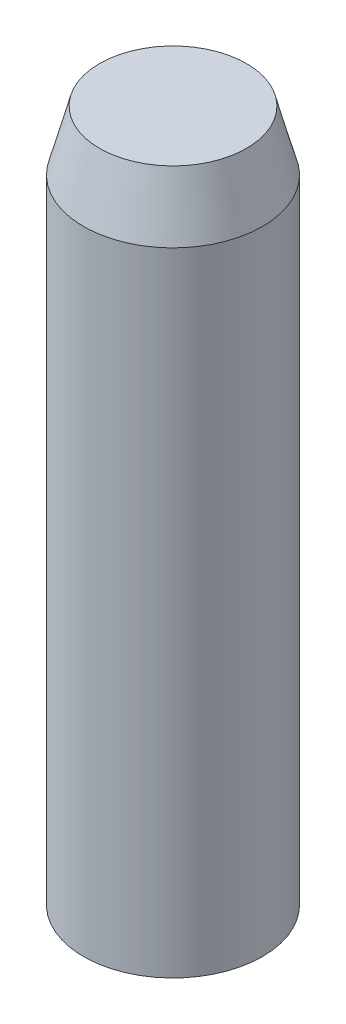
ISO-10303-21;
HEADER;
FILE_DESCRIPTION(('STEP AP214'),'2;1');
FILE_NAME('part.step','',(''),(''),'','','');
FILE_SCHEMA(('AUTOMOTIVE_DESIGN { 1 0 10303 214 1 1 1 1 }'));
ENDSEC;
DATA;
#1=APPLICATION_CONTEXT('core data for automotive mechanical design processes');
#2=APPLICATION_PROTOCOL_DEFINITION('international standard','automotive_design',2000,#1);
#3=PRODUCT_CONTEXT('',#1,'mechanical');
#4=PRODUCT('Part','Part','',(#3));
#5=PRODUCT_RELATED_PRODUCT_CATEGORY('part','',(#4));
#6=PRODUCT_DEFINITION_FORMATION('','',#4);
#7=PRODUCT_DEFINITION_CONTEXT('part definition',#1,'design');
#8=PRODUCT_DEFINITION('design','',#6,#7);
#9=PRODUCT_DEFINITION_SHAPE('','',#8);
#10=(LENGTH_UNIT() NAMED_UNIT(*) SI_UNIT(.MILLI.,.METRE.));
#11=(NAMED_UNIT(*) PLANE_ANGLE_UNIT() SI_UNIT($,.RADIAN.));
#12=(NAMED_UNIT(*) SI_UNIT($,.STERADIAN.) SOLID_ANGLE_UNIT());
#13=UNCERTAINTY_MEASURE_WITH_UNIT(LENGTH_MEASURE(1.E-05),#10,'distance_accuracy_value','');
#14=(GEOMETRIC_REPRESENTATION_CONTEXT(3) GLOBAL_UNCERTAINTY_ASSIGNED_CONTEXT((#13)) GLOBAL_UNIT_ASSIGNED_CONTEXT((#10,
#11,#12)) REPRESENTATION_CONTEXT('',''));
#15=CARTESIAN_POINT('',(0.,0.,0.));
#16=DIRECTION('',(0.,0.,1.));
#17=DIRECTION('',(1.,0.,0.));
#18=AXIS2_PLACEMENT_3D('',#15,#16,#17);
#19=CARTESIAN_POINT('',(0.,16.,0.));
#20=DIRECTION('',(0.,-1.,0.));
#21=DIRECTION('',(1.,0.,0.));
#22=AXIS2_PLACEMENT_3D('',#19,#20,#21);
#23=PLANE('',#22);
#24=CARTESIAN_POINT('',(0.,16.,0.));
#25=DIRECTION('',(0.,1.,0.));
#26=DIRECTION('',(-1.,0.,0.));
#27=AXIS2_PLACEMENT_3D('',#24,#25,#26);
#28=CIRCLE('',#27,1.64273441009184);
#29=CARTESIAN_POINT('',(-1.64273441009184,16.,0.));
#30=VERTEX_POINT('',#29);
#31=EDGE_CURVE('E10',#30,#30,#28,.T.);
#32=ORIENTED_EDGE('',*,*,#31,.T.);
#33=EDGE_LOOP('',(#32));
#34=FACE_BOUND('',#33,.T.);
#35=ADVANCED_FACE('F34',(#34),#23,.F.);
#36=CARTESIAN_POINT('',(0.,14.6666666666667,0.));
#37=DIRECTION('',(0.,-1.,0.));
#38=DIRECTION('',(1.,0.,0.));
#39=AXIS2_PLACEMENT_3D('',#36,#37,#38);
#40=CONICAL_SURFACE('',#39,2.,0.261799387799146);
#41=ORIENTED_EDGE('',*,*,#31,.F.);
#42=EDGE_LOOP('',(#41));
#43=FACE_BOUND('',#42,.T.);
#44=CARTESIAN_POINT('',(0.,14.6666666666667,0.));
#45=DIRECTION('',(0.,1.,0.));
#46=DIRECTION('',(-1.,0.,0.));
#47=AXIS2_PLACEMENT_3D('',#44,#45,#46);
#48=CIRCLE('',#47,2.);
#49=CARTESIAN_POINT('',(-2.,14.6666666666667,0.));
#50=VERTEX_POINT('',#49);
#51=EDGE_CURVE('E40',#50,#50,#48,.T.);
#52=ORIENTED_EDGE('',*,*,#51,.T.);
#53=EDGE_LOOP('',(#52));
#54=FACE_BOUND('',#53,.T.);
#55=ADVANCED_FACE('F59',(#43,#54),#40,.T.);
#56=CARTESIAN_POINT('',(0.,16.,0.));
#57=DIRECTION('',(0.,1.,0.));
#58=DIRECTION('',(-1.,0.,0.));
#59=AXIS2_PLACEMENT_3D('',#56,#57,#58);
#60=CYLINDRICAL_SURFACE('',#59,2.);
#61=ORIENTED_EDGE('',*,*,#51,.F.);
#62=EDGE_LOOP('',(#61));
#63=FACE_BOUND('',#62,.T.);
#64=CARTESIAN_POINT('',(0.,0.535898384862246,0.));
#65=DIRECTION('',(0.,1.,0.));
#66=DIRECTION('',(-1.,0.,0.));
#67=AXIS2_PLACEMENT_3D('',#64,#65,#66);
#68=CIRCLE('',#67,2.);
#69=CARTESIAN_POINT('',(-2.,0.535898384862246,0.));
#70=VERTEX_POINT('',#69);
#71=EDGE_CURVE('E44',#70,#70,#68,.T.);
#72=ORIENTED_EDGE('',*,*,#71,.T.);
#73=EDGE_LOOP('',(#72));
#74=FACE_BOUND('',#73,.T.);
#75=ADVANCED_FACE('F51',(#63,#74),#60,.T.);
#76=CARTESIAN_POINT('',(0.,4.,0.));
#77=DIRECTION('',(0.,1.,0.));
#78=DIRECTION('',(-1.,0.,0.));
#79=AXIS2_PLACEMENT_3D('',#76,#77,#78);
#80=SPHERICAL_SURFACE('',#79,4.);
#81=ORIENTED_EDGE('',*,*,#71,.F.);
#82=EDGE_LOOP('',(#81));
#83=FACE_BOUND('',#82,.T.);
#84=ADVANCED_FACE('F53',(#83),#80,.T.);
#85=CLOSED_SHELL('',(#35,#55,#75,#84));
#86=MANIFOLD_SOLID_BREP('B2',#85);
#87=ADVANCED_BREP_SHAPE_REPRESENTATION('',(#18,#86),#14);
#88=SHAPE_DEFINITION_REPRESENTATION(#9,#87);
ENDSEC;
END-ISO-10303-21;
